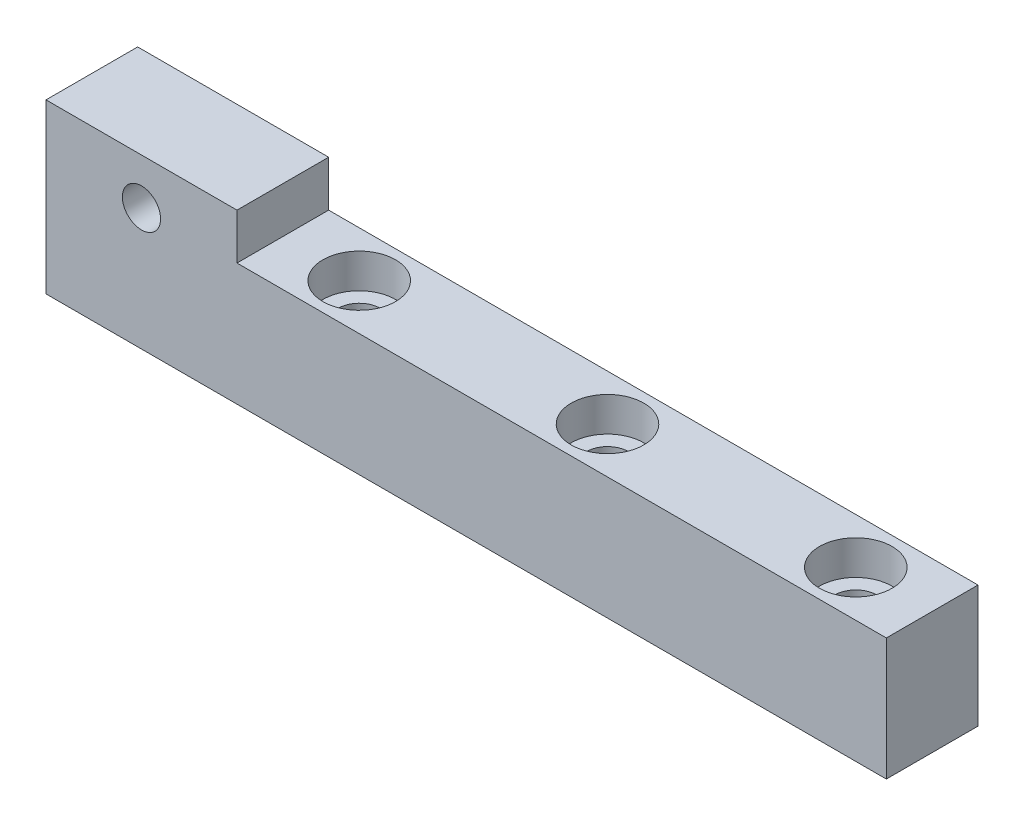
ISO-10303-21;
HEADER;
FILE_DESCRIPTION(('STEP AP214'),'2;1');
FILE_NAME('part.step','',(''),(''),'','','');
FILE_SCHEMA(('AUTOMOTIVE_DESIGN { 1 0 10303 214 1 1 1 1 }'));
ENDSEC;
DATA;
#1=APPLICATION_CONTEXT('core data for automotive mechanical design processes');
#2=APPLICATION_PROTOCOL_DEFINITION('international standard','automotive_design',2000,#1);
#3=PRODUCT_CONTEXT('',#1,'mechanical');
#4=PRODUCT('Part','Part','',(#3));
#5=PRODUCT_RELATED_PRODUCT_CATEGORY('part','',(#4));
#6=PRODUCT_DEFINITION_FORMATION('','',#4);
#7=PRODUCT_DEFINITION_CONTEXT('part definition',#1,'design');
#8=PRODUCT_DEFINITION('design','',#6,#7);
#9=PRODUCT_DEFINITION_SHAPE('','',#8);
#10=(LENGTH_UNIT() NAMED_UNIT(*) SI_UNIT(.MILLI.,.METRE.));
#11=(NAMED_UNIT(*) PLANE_ANGLE_UNIT() SI_UNIT($,.RADIAN.));
#12=(NAMED_UNIT(*) SI_UNIT($,.STERADIAN.) SOLID_ANGLE_UNIT());
#13=UNCERTAINTY_MEASURE_WITH_UNIT(LENGTH_MEASURE(1.E-05),#10,'distance_accuracy_value','');
#14=(GEOMETRIC_REPRESENTATION_CONTEXT(3) GLOBAL_UNCERTAINTY_ASSIGNED_CONTEXT((#13)) GLOBAL_UNIT_ASSIGNED_CONTEXT((#10,
#11,#12)) REPRESENTATION_CONTEXT('',''));
#15=CARTESIAN_POINT('',(0.,0.,0.));
#16=DIRECTION('',(0.,0.,1.));
#17=DIRECTION('',(1.,0.,0.));
#18=AXIS2_PLACEMENT_3D('',#15,#16,#17);
#19=CARTESIAN_POINT('',(35.0000000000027,-1.14491749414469E-13,6.));
#20=DIRECTION('',(0.,1.,0.));
#21=DIRECTION('',(0.,0.,1.));
#22=AXIS2_PLACEMENT_3D('',#19,#20,#21);
#23=CYLINDRICAL_SURFACE('',#22,2.75);
#24=CARTESIAN_POINT('',(35.0000000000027,-1.14491749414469E-13,6.));
#25=DIRECTION('',(0.,1.,0.));
#26=DIRECTION('',(0.,0.,1.));
#27=AXIS2_PLACEMENT_3D('',#24,#25,#26);
#28=CIRCLE('',#27,2.75);
#29=CARTESIAN_POINT('',(35.0000000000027,-1.14491749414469E-13,8.75));
#30=VERTEX_POINT('',#29);
#31=EDGE_CURVE('E139',#30,#30,#28,.T.);
#32=ORIENTED_EDGE('',*,*,#31,.F.);
#33=EDGE_LOOP('',(#32));
#34=FACE_BOUND('',#33,.T.);
#35=CARTESIAN_POINT('',(35.0000000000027,11.5,6.));
#36=DIRECTION('',(0.,1.,0.));
#37=DIRECTION('',(0.,0.,1.));
#38=AXIS2_PLACEMENT_3D('',#35,#36,#37);
#39=CIRCLE('',#38,2.75);
#40=CARTESIAN_POINT('',(35.0000000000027,11.5,8.75));
#41=VERTEX_POINT('',#40);
#42=EDGE_CURVE('E36',#41,#41,#39,.F.);
#43=ORIENTED_EDGE('',*,*,#42,.F.);
#44=EDGE_LOOP('',(#43));
#45=FACE_BOUND('',#44,.T.);
#46=ADVANCED_FACE('F32',(#34,#45),#23,.F.);
#47=CARTESIAN_POINT('',(67.5000000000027,-1.14491749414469E-13,6.));
#48=DIRECTION('',(0.,1.,0.));
#49=DIRECTION('',(0.,0.,1.));
#50=AXIS2_PLACEMENT_3D('',#47,#48,#49);
#51=CYLINDRICAL_SURFACE('',#50,2.75);
#52=CARTESIAN_POINT('',(67.5000000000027,-1.14491749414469E-13,6.));
#53=DIRECTION('',(0.,1.,0.));
#54=DIRECTION('',(0.,0.,1.));
#55=AXIS2_PLACEMENT_3D('',#52,#53,#54);
#56=CIRCLE('',#55,2.75);
#57=CARTESIAN_POINT('',(67.5000000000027,-1.14491749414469E-13,8.75));
#58=VERTEX_POINT('',#57);
#59=EDGE_CURVE('E164',#58,#58,#56,.T.);
#60=ORIENTED_EDGE('',*,*,#59,.F.);
#61=EDGE_LOOP('',(#60));
#62=FACE_BOUND('',#61,.T.);
#63=CARTESIAN_POINT('',(67.5000000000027,11.5,6.));
#64=DIRECTION('',(0.,1.,0.));
#65=DIRECTION('',(0.,0.,1.));
#66=AXIS2_PLACEMENT_3D('',#63,#64,#65);
#67=CIRCLE('',#66,2.75);
#68=CARTESIAN_POINT('',(67.5000000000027,11.5,8.75));
#69=VERTEX_POINT('',#68);
#70=EDGE_CURVE('E141',#69,#69,#67,.F.);
#71=ORIENTED_EDGE('',*,*,#70,.F.);
#72=EDGE_LOOP('',(#71));
#73=FACE_BOUND('',#72,.T.);
#74=ADVANCED_FACE('F201',(#62,#73),#51,.F.);
#75=CARTESIAN_POINT('',(99.9999999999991,-1.14491749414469E-13,6.));
#76=DIRECTION('',(0.,1.,0.));
#77=DIRECTION('',(0.,0.,1.));
#78=AXIS2_PLACEMENT_3D('',#75,#76,#77);
#79=CYLINDRICAL_SURFACE('',#78,2.75);
#80=CARTESIAN_POINT('',(99.9999999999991,-1.14491749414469E-13,6.));
#81=DIRECTION('',(0.,1.,0.));
#82=DIRECTION('',(0.,0.,1.));
#83=AXIS2_PLACEMENT_3D('',#80,#81,#82);
#84=CIRCLE('',#83,2.75);
#85=CARTESIAN_POINT('',(99.9999999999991,-1.14491749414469E-13,8.75));
#86=VERTEX_POINT('',#85);
#87=EDGE_CURVE('E167',#86,#86,#84,.T.);
#88=ORIENTED_EDGE('',*,*,#87,.F.);
#89=EDGE_LOOP('',(#88));
#90=FACE_BOUND('',#89,.T.);
#91=CARTESIAN_POINT('',(99.9999999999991,11.5,6.));
#92=DIRECTION('',(0.,1.,0.));
#93=DIRECTION('',(0.,0.,1.));
#94=AXIS2_PLACEMENT_3D('',#91,#92,#93);
#95=CIRCLE('',#94,2.75);
#96=CARTESIAN_POINT('',(99.9999999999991,11.5,8.75));
#97=VERTEX_POINT('',#96);
#98=EDGE_CURVE('E137',#97,#97,#95,.F.);
#99=ORIENTED_EDGE('',*,*,#98,.F.);
#100=EDGE_LOOP('',(#99));
#101=FACE_BOUND('',#100,.T.);
#102=ADVANCED_FACE('F207',(#90,#101),#79,.F.);
#103=CARTESIAN_POINT('',(109.999999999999,-1.13686837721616E-13,12.));
#104=DIRECTION('',(0.,0.,1.));
#105=DIRECTION('',(1.,0.,0.));
#106=AXIS2_PLACEMENT_3D('',#103,#104,#105);
#107=PLANE('',#106);
#108=DIRECTION('',(1.,0.,0.));
#109=VECTOR('',#108,1.);
#110=CARTESIAN_POINT('',(0.,-1.13686837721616E-13,12.));
#111=LINE('',#110,#109);
#112=CARTESIAN_POINT('',(0.,-1.13686837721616E-13,12.));
#113=VERTEX_POINT('',#112);
#114=CARTESIAN_POINT('',(109.999999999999,-1.13686837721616E-13,12.));
#115=VERTEX_POINT('',#114);
#116=EDGE_CURVE('E131',#113,#115,#111,.T.);
#117=ORIENTED_EDGE('',*,*,#116,.T.);
#118=DIRECTION('',(0.,1.,0.));
#119=VECTOR('',#118,1.);
#120=CARTESIAN_POINT('',(109.999999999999,-1.13686837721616E-13,12.));
#121=LINE('',#120,#119);
#122=CARTESIAN_POINT('',(109.999999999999,16.,12.));
#123=VERTEX_POINT('',#122);
#124=EDGE_CURVE('E88',#115,#123,#121,.T.);
#125=ORIENTED_EDGE('',*,*,#124,.T.);
#126=DIRECTION('',(-1.,0.,0.));
#127=VECTOR('',#126,1.);
#128=CARTESIAN_POINT('',(25.,16.,12.));
#129=LINE('',#128,#127);
#130=CARTESIAN_POINT('',(25.,16.,12.));
#131=VERTEX_POINT('',#130);
#132=EDGE_CURVE('E102',#123,#131,#129,.T.);
#133=ORIENTED_EDGE('',*,*,#132,.T.);
#134=DIRECTION('',(0.,1.,0.));
#135=VECTOR('',#134,1.);
#136=CARTESIAN_POINT('',(25.,16.,12.));
#137=LINE('',#136,#135);
#138=CARTESIAN_POINT('',(25.,21.9999999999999,12.));
#139=VERTEX_POINT('',#138);
#140=EDGE_CURVE('E95',#131,#139,#137,.T.);
#141=ORIENTED_EDGE('',*,*,#140,.T.);
#142=DIRECTION('',(-1.,0.,0.));
#143=VECTOR('',#142,1.);
#144=CARTESIAN_POINT('',(0.,21.9999999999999,12.));
#145=LINE('',#144,#143);
#146=CARTESIAN_POINT('',(0.,21.9999999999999,12.));
#147=VERTEX_POINT('',#146);
#148=EDGE_CURVE('E100',#139,#147,#145,.T.);
#149=ORIENTED_EDGE('',*,*,#148,.T.);
#150=DIRECTION('',(0.,-1.,0.));
#151=VECTOR('',#150,1.);
#152=CARTESIAN_POINT('',(0.,-1.13686837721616E-13,12.));
#153=LINE('',#152,#151);
#154=EDGE_CURVE('E51',#147,#113,#153,.T.);
#155=ORIENTED_EDGE('',*,*,#154,.T.);
#156=EDGE_LOOP('',(#117,#125,#133,#141,#149,#155));
#157=FACE_BOUND('',#156,.T.);
#158=CARTESIAN_POINT('',(12.5,16.,12.));
#159=DIRECTION('',(0.,0.,1.));
#160=DIRECTION('',(1.,0.,0.));
#161=AXIS2_PLACEMENT_3D('',#158,#159,#160);
#162=CIRCLE('',#161,2.5);
#163=CARTESIAN_POINT('',(15.,16.,12.));
#164=VERTEX_POINT('',#163);
#165=EDGE_CURVE('E124',#164,#164,#162,.T.);
#166=ORIENTED_EDGE('',*,*,#165,.F.);
#167=EDGE_LOOP('',(#166));
#168=FACE_BOUND('',#167,.T.);
#169=ADVANCED_FACE('F97',(#157,#168),#107,.T.);
#170=CARTESIAN_POINT('',(109.999999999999,-1.13686837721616E-13,0.));
#171=DIRECTION('',(0.,0.,1.));
#172=DIRECTION('',(1.,0.,0.));
#173=AXIS2_PLACEMENT_3D('',#170,#171,#172);
#174=PLANE('',#173);
#175=DIRECTION('',(1.,0.,0.));
#176=VECTOR('',#175,1.);
#177=CARTESIAN_POINT('',(0.,-1.13686837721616E-13,0.));
#178=LINE('',#177,#176);
#179=CARTESIAN_POINT('',(0.,-1.13686837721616E-13,0.));
#180=VERTEX_POINT('',#179);
#181=CARTESIAN_POINT('',(109.999999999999,-1.13686837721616E-13,0.));
#182=VERTEX_POINT('',#181);
#183=EDGE_CURVE('E120',#180,#182,#178,.T.);
#184=ORIENTED_EDGE('',*,*,#183,.F.);
#185=DIRECTION('',(0.,-1.,0.));
#186=VECTOR('',#185,1.);
#187=CARTESIAN_POINT('',(0.,-1.13686837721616E-13,0.));
#188=LINE('',#187,#186);
#189=CARTESIAN_POINT('',(0.,21.9999999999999,0.));
#190=VERTEX_POINT('',#189);
#191=EDGE_CURVE('E80',#190,#180,#188,.T.);
#192=ORIENTED_EDGE('',*,*,#191,.F.);
#193=DIRECTION('',(-1.,0.,0.));
#194=VECTOR('',#193,1.);
#195=CARTESIAN_POINT('',(0.,21.9999999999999,0.));
#196=LINE('',#195,#194);
#197=CARTESIAN_POINT('',(25.,21.9999999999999,0.));
#198=VERTEX_POINT('',#197);
#199=EDGE_CURVE('E74',#198,#190,#196,.T.);
#200=ORIENTED_EDGE('',*,*,#199,.F.);
#201=DIRECTION('',(0.,1.,0.));
#202=VECTOR('',#201,1.);
#203=CARTESIAN_POINT('',(25.,16.,0.));
#204=LINE('',#203,#202);
#205=CARTESIAN_POINT('',(25.,16.,0.));
#206=VERTEX_POINT('',#205);
#207=EDGE_CURVE('E110',#206,#198,#204,.T.);
#208=ORIENTED_EDGE('',*,*,#207,.F.);
#209=DIRECTION('',(-1.,0.,0.));
#210=VECTOR('',#209,1.);
#211=CARTESIAN_POINT('',(25.,16.,0.));
#212=LINE('',#211,#210);
#213=CARTESIAN_POINT('',(109.999999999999,16.,0.));
#214=VERTEX_POINT('',#213);
#215=EDGE_CURVE('E126',#214,#206,#212,.T.);
#216=ORIENTED_EDGE('',*,*,#215,.F.);
#217=DIRECTION('',(0.,1.,0.));
#218=VECTOR('',#217,1.);
#219=CARTESIAN_POINT('',(109.999999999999,-1.13686837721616E-13,0.));
#220=LINE('',#219,#218);
#221=EDGE_CURVE('E123',#182,#214,#220,.T.);
#222=ORIENTED_EDGE('',*,*,#221,.F.);
#223=EDGE_LOOP('',(#184,#192,#200,#208,#216,#222));
#224=FACE_BOUND('',#223,.T.);
#225=CARTESIAN_POINT('',(12.5,16.,0.));
#226=DIRECTION('',(0.,0.,1.));
#227=DIRECTION('',(1.,0.,0.));
#228=AXIS2_PLACEMENT_3D('',#225,#226,#227);
#229=CIRCLE('',#228,2.5);
#230=CARTESIAN_POINT('',(15.,16.,0.));
#231=VERTEX_POINT('',#230);
#232=EDGE_CURVE('E170',#231,#231,#229,.T.);
#233=ORIENTED_EDGE('',*,*,#232,.T.);
#234=EDGE_LOOP('',(#233));
#235=FACE_BOUND('',#234,.T.);
#236=ADVANCED_FACE('F184',(#224,#235),#174,.F.);
#237=CARTESIAN_POINT('',(0.,-1.13686837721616E-13,12.));
#238=DIRECTION('',(0.,1.,0.));
#239=DIRECTION('',(0.,0.,1.));
#240=AXIS2_PLACEMENT_3D('',#237,#238,#239);
#241=PLANE('',#240);
#242=ORIENTED_EDGE('',*,*,#31,.T.);
#243=EDGE_LOOP('',(#242));
#244=FACE_BOUND('',#243,.T.);
#245=ORIENTED_EDGE('',*,*,#59,.T.);
#246=EDGE_LOOP('',(#245));
#247=FACE_BOUND('',#246,.T.);
#248=ORIENTED_EDGE('',*,*,#87,.T.);
#249=EDGE_LOOP('',(#248));
#250=FACE_BOUND('',#249,.T.);
#251=ORIENTED_EDGE('',*,*,#183,.T.);
#252=DIRECTION('',(0.,0.,-1.));
#253=VECTOR('',#252,1.);
#254=CARTESIAN_POINT('',(109.999999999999,-1.13686837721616E-13,12.));
#255=LINE('',#254,#253);
#256=EDGE_CURVE('E11',#115,#182,#255,.T.);
#257=ORIENTED_EDGE('',*,*,#256,.F.);
#258=ORIENTED_EDGE('',*,*,#116,.F.);
#259=DIRECTION('',(0.,0.,-1.));
#260=VECTOR('',#259,1.);
#261=CARTESIAN_POINT('',(0.,-1.13686837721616E-13,12.));
#262=LINE('',#261,#260);
#263=EDGE_CURVE('E116',#113,#180,#262,.T.);
#264=ORIENTED_EDGE('',*,*,#263,.T.);
#265=EDGE_LOOP('',(#251,#257,#258,#264));
#266=FACE_BOUND('',#265,.T.);
#267=ADVANCED_FACE('F34',(#244,#247,#250,#266),#241,.F.);
#268=CARTESIAN_POINT('',(109.999999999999,-1.13686837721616E-13,12.));
#269=DIRECTION('',(-1.,0.,0.));
#270=DIRECTION('',(0.,0.,1.));
#271=AXIS2_PLACEMENT_3D('',#268,#269,#270);
#272=PLANE('',#271);
#273=ORIENTED_EDGE('',*,*,#221,.T.);
#274=DIRECTION('',(0.,0.,-1.));
#275=VECTOR('',#274,1.);
#276=CARTESIAN_POINT('',(109.999999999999,16.,12.));
#277=LINE('',#276,#275);
#278=EDGE_CURVE('E42',#123,#214,#277,.T.);
#279=ORIENTED_EDGE('',*,*,#278,.F.);
#280=ORIENTED_EDGE('',*,*,#124,.F.);
#281=ORIENTED_EDGE('',*,*,#256,.T.);
#282=EDGE_LOOP('',(#273,#279,#280,#281));
#283=FACE_BOUND('',#282,.T.);
#284=ADVANCED_FACE('F178',(#283),#272,.F.);
#285=CARTESIAN_POINT('',(25.,16.,12.));
#286=DIRECTION('',(0.,-1.,0.));
#287=DIRECTION('',(0.,0.,-1.));
#288=AXIS2_PLACEMENT_3D('',#285,#286,#287);
#289=PLANE('',#288);
#290=CARTESIAN_POINT('',(35.0000000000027,16.,6.));
#291=DIRECTION('',(0.,1.,0.));
#292=DIRECTION('',(0.,0.,1.));
#293=AXIS2_PLACEMENT_3D('',#290,#291,#292);
#294=CIRCLE('',#293,4.75);
#295=CARTESIAN_POINT('',(35.0000000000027,16.,10.75));
#296=VERTEX_POINT('',#295);
#297=EDGE_CURVE('E157',#296,#296,#294,.T.);
#298=ORIENTED_EDGE('',*,*,#297,.F.);
#299=EDGE_LOOP('',(#298));
#300=FACE_BOUND('',#299,.T.);
#301=CARTESIAN_POINT('',(67.5000000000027,16.,6.));
#302=DIRECTION('',(0.,1.,0.));
#303=DIRECTION('',(0.,0.,1.));
#304=AXIS2_PLACEMENT_3D('',#301,#302,#303);
#305=CIRCLE('',#304,4.75);
#306=CARTESIAN_POINT('',(67.5000000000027,16.,10.75));
#307=VERTEX_POINT('',#306);
#308=EDGE_CURVE('E150',#307,#307,#305,.T.);
#309=ORIENTED_EDGE('',*,*,#308,.F.);
#310=EDGE_LOOP('',(#309));
#311=FACE_BOUND('',#310,.T.);
#312=CARTESIAN_POINT('',(99.9999999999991,16.,6.));
#313=DIRECTION('',(0.,1.,0.));
#314=DIRECTION('',(0.,0.,1.));
#315=AXIS2_PLACEMENT_3D('',#312,#313,#314);
#316=CIRCLE('',#315,4.75);
#317=CARTESIAN_POINT('',(99.9999999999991,16.,10.75));
#318=VERTEX_POINT('',#317);
#319=EDGE_CURVE('E143',#318,#318,#316,.T.);
#320=ORIENTED_EDGE('',*,*,#319,.F.);
#321=EDGE_LOOP('',(#320));
#322=FACE_BOUND('',#321,.T.);
#323=ORIENTED_EDGE('',*,*,#215,.T.);
#324=DIRECTION('',(0.,0.,-1.));
#325=VECTOR('',#324,1.);
#326=CARTESIAN_POINT('',(25.,16.,12.));
#327=LINE('',#326,#325);
#328=EDGE_CURVE('E111',#131,#206,#327,.T.);
#329=ORIENTED_EDGE('',*,*,#328,.F.);
#330=ORIENTED_EDGE('',*,*,#132,.F.);
#331=ORIENTED_EDGE('',*,*,#278,.T.);
#332=EDGE_LOOP('',(#323,#329,#330,#331));
#333=FACE_BOUND('',#332,.T.);
#334=ADVANCED_FACE('F181',(#300,#311,#322,#333),#289,.F.);
#335=CARTESIAN_POINT('',(25.,16.,12.));
#336=DIRECTION('',(-1.,0.,0.));
#337=DIRECTION('',(0.,0.,1.));
#338=AXIS2_PLACEMENT_3D('',#335,#336,#337);
#339=PLANE('',#338);
#340=ORIENTED_EDGE('',*,*,#207,.T.);
#341=DIRECTION('',(0.,0.,-1.));
#342=VECTOR('',#341,1.);
#343=CARTESIAN_POINT('',(25.,21.9999999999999,12.));
#344=LINE('',#343,#342);
#345=EDGE_CURVE('E107',#139,#198,#344,.T.);
#346=ORIENTED_EDGE('',*,*,#345,.F.);
#347=ORIENTED_EDGE('',*,*,#140,.F.);
#348=ORIENTED_EDGE('',*,*,#328,.T.);
#349=EDGE_LOOP('',(#340,#346,#347,#348));
#350=FACE_BOUND('',#349,.T.);
#351=ADVANCED_FACE('F108',(#350),#339,.F.);
#352=CARTESIAN_POINT('',(0.,21.9999999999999,12.));
#353=DIRECTION('',(0.,-1.,0.));
#354=DIRECTION('',(0.,0.,-1.));
#355=AXIS2_PLACEMENT_3D('',#352,#353,#354);
#356=PLANE('',#355);
#357=ORIENTED_EDGE('',*,*,#199,.T.);
#358=DIRECTION('',(0.,0.,-1.));
#359=VECTOR('',#358,1.);
#360=CARTESIAN_POINT('',(0.,21.9999999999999,12.));
#361=LINE('',#360,#359);
#362=EDGE_CURVE('E112',#147,#190,#361,.T.);
#363=ORIENTED_EDGE('',*,*,#362,.F.);
#364=ORIENTED_EDGE('',*,*,#148,.F.);
#365=ORIENTED_EDGE('',*,*,#345,.T.);
#366=EDGE_LOOP('',(#357,#363,#364,#365));
#367=FACE_BOUND('',#366,.T.);
#368=ADVANCED_FACE('F114',(#367),#356,.F.);
#369=CARTESIAN_POINT('',(0.,-1.13686837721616E-13,12.));
#370=DIRECTION('',(1.,0.,0.));
#371=DIRECTION('',(0.,0.,-1.));
#372=AXIS2_PLACEMENT_3D('',#369,#370,#371);
#373=PLANE('',#372);
#374=ORIENTED_EDGE('',*,*,#191,.T.);
#375=ORIENTED_EDGE('',*,*,#263,.F.);
#376=ORIENTED_EDGE('',*,*,#154,.F.);
#377=ORIENTED_EDGE('',*,*,#362,.T.);
#378=EDGE_LOOP('',(#374,#375,#376,#377));
#379=FACE_BOUND('',#378,.T.);
#380=ADVANCED_FACE('F187',(#379),#373,.F.);
#381=CARTESIAN_POINT('',(12.5,16.,12.));
#382=DIRECTION('',(0.,0.,-1.));
#383=DIRECTION('',(-1.,0.,0.));
#384=AXIS2_PLACEMENT_3D('',#381,#382,#383);
#385=CYLINDRICAL_SURFACE('',#384,2.5);
#386=ORIENTED_EDGE('',*,*,#165,.T.);
#387=EDGE_LOOP('',(#386));
#388=FACE_BOUND('',#387,.T.);
#389=ORIENTED_EDGE('',*,*,#232,.F.);
#390=EDGE_LOOP('',(#389));
#391=FACE_BOUND('',#390,.T.);
#392=ADVANCED_FACE('F189',(#388,#391),#385,.F.);
#393=CARTESIAN_POINT('',(99.9999999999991,11.5,6.));
#394=DIRECTION('',(0.,1.,0.));
#395=DIRECTION('',(0.,0.,1.));
#396=AXIS2_PLACEMENT_3D('',#393,#394,#395);
#397=PLANE('',#396);
#398=CARTESIAN_POINT('',(99.9999999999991,11.5,6.));
#399=DIRECTION('',(0.,1.,0.));
#400=DIRECTION('',(0.,0.,1.));
#401=AXIS2_PLACEMENT_3D('',#398,#399,#400);
#402=CIRCLE('',#401,4.75);
#403=CARTESIAN_POINT('',(99.9999999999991,11.5,10.75));
#404=VERTEX_POINT('',#403);
#405=EDGE_CURVE('E140',#404,#404,#402,.T.);
#406=ORIENTED_EDGE('',*,*,#405,.T.);
#407=EDGE_LOOP('',(#406));
#408=FACE_BOUND('',#407,.T.);
#409=ORIENTED_EDGE('',*,*,#98,.T.);
#410=EDGE_LOOP('',(#409));
#411=FACE_BOUND('',#410,.T.);
#412=ADVANCED_FACE('F195',(#408,#411),#397,.T.);
#413=CARTESIAN_POINT('',(99.9999999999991,11.5,6.));
#414=DIRECTION('',(0.,1.,0.));
#415=DIRECTION('',(0.,0.,1.));
#416=AXIS2_PLACEMENT_3D('',#413,#414,#415);
#417=CYLINDRICAL_SURFACE('',#416,4.75);
#418=ORIENTED_EDGE('',*,*,#405,.F.);
#419=EDGE_LOOP('',(#418));
#420=FACE_BOUND('',#419,.T.);
#421=ORIENTED_EDGE('',*,*,#319,.T.);
#422=EDGE_LOOP('',(#421));
#423=FACE_BOUND('',#422,.T.);
#424=ADVANCED_FACE('F213',(#420,#423),#417,.F.);
#425=CARTESIAN_POINT('',(67.5000000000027,11.5,6.));
#426=DIRECTION('',(0.,1.,0.));
#427=DIRECTION('',(0.,0.,1.));
#428=AXIS2_PLACEMENT_3D('',#425,#426,#427);
#429=PLANE('',#428);
#430=CARTESIAN_POINT('',(67.5000000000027,11.5,6.));
#431=DIRECTION('',(0.,1.,0.));
#432=DIRECTION('',(0.,0.,1.));
#433=AXIS2_PLACEMENT_3D('',#430,#431,#432);
#434=CIRCLE('',#433,4.75);
#435=CARTESIAN_POINT('',(67.5000000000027,11.5,10.75));
#436=VERTEX_POINT('',#435);
#437=EDGE_CURVE('E144',#436,#436,#434,.T.);
#438=ORIENTED_EDGE('',*,*,#437,.T.);
#439=EDGE_LOOP('',(#438));
#440=FACE_BOUND('',#439,.T.);
#441=ORIENTED_EDGE('',*,*,#70,.T.);
#442=EDGE_LOOP('',(#441));
#443=FACE_BOUND('',#442,.T.);
#444=ADVANCED_FACE('F240',(#440,#443),#429,.T.);
#445=CARTESIAN_POINT('',(67.5000000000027,11.5,6.));
#446=DIRECTION('',(0.,1.,0.));
#447=DIRECTION('',(0.,0.,1.));
#448=AXIS2_PLACEMENT_3D('',#445,#446,#447);
#449=CYLINDRICAL_SURFACE('',#448,4.75);
#450=ORIENTED_EDGE('',*,*,#437,.F.);
#451=EDGE_LOOP('',(#450));
#452=FACE_BOUND('',#451,.T.);
#453=ORIENTED_EDGE('',*,*,#308,.T.);
#454=EDGE_LOOP('',(#453));
#455=FACE_BOUND('',#454,.T.);
#456=ADVANCED_FACE('F243',(#452,#455),#449,.F.);
#457=CARTESIAN_POINT('',(35.0000000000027,11.5,6.));
#458=DIRECTION('',(0.,1.,0.));
#459=DIRECTION('',(0.,0.,1.));
#460=AXIS2_PLACEMENT_3D('',#457,#458,#459);
#461=PLANE('',#460);
#462=CARTESIAN_POINT('',(35.0000000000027,11.5,6.));
#463=DIRECTION('',(0.,1.,0.));
#464=DIRECTION('',(0.,0.,1.));
#465=AXIS2_PLACEMENT_3D('',#462,#463,#464);
#466=CIRCLE('',#465,4.75);
#467=CARTESIAN_POINT('',(35.0000000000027,11.5,10.75));
#468=VERTEX_POINT('',#467);
#469=EDGE_CURVE('E261',#468,#468,#466,.T.);
#470=ORIENTED_EDGE('',*,*,#469,.T.);
#471=EDGE_LOOP('',(#470));
#472=FACE_BOUND('',#471,.T.);
#473=ORIENTED_EDGE('',*,*,#42,.T.);
#474=EDGE_LOOP('',(#473));
#475=FACE_BOUND('',#474,.T.);
#476=ADVANCED_FACE('F246',(#472,#475),#461,.T.);
#477=CARTESIAN_POINT('',(35.0000000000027,11.5,6.));
#478=DIRECTION('',(0.,1.,0.));
#479=DIRECTION('',(0.,0.,1.));
#480=AXIS2_PLACEMENT_3D('',#477,#478,#479);
#481=CYLINDRICAL_SURFACE('',#480,4.75);
#482=ORIENTED_EDGE('',*,*,#469,.F.);
#483=EDGE_LOOP('',(#482));
#484=FACE_BOUND('',#483,.T.);
#485=ORIENTED_EDGE('',*,*,#297,.T.);
#486=EDGE_LOOP('',(#485));
#487=FACE_BOUND('',#486,.T.);
#488=ADVANCED_FACE('F250',(#484,#487),#481,.F.);
#489=CLOSED_SHELL('',(#46,#74,#102,#169,#236,#267,#284,#334,#351,#368,#380,#392,#412,#424,#444,
#456,#476,#488));
#490=MANIFOLD_SOLID_BREP('B2',#489);
#491=ADVANCED_BREP_SHAPE_REPRESENTATION('',(#18,#490),#14);
#492=SHAPE_DEFINITION_REPRESENTATION(#9,#491);
ENDSEC;
END-ISO-10303-21;
